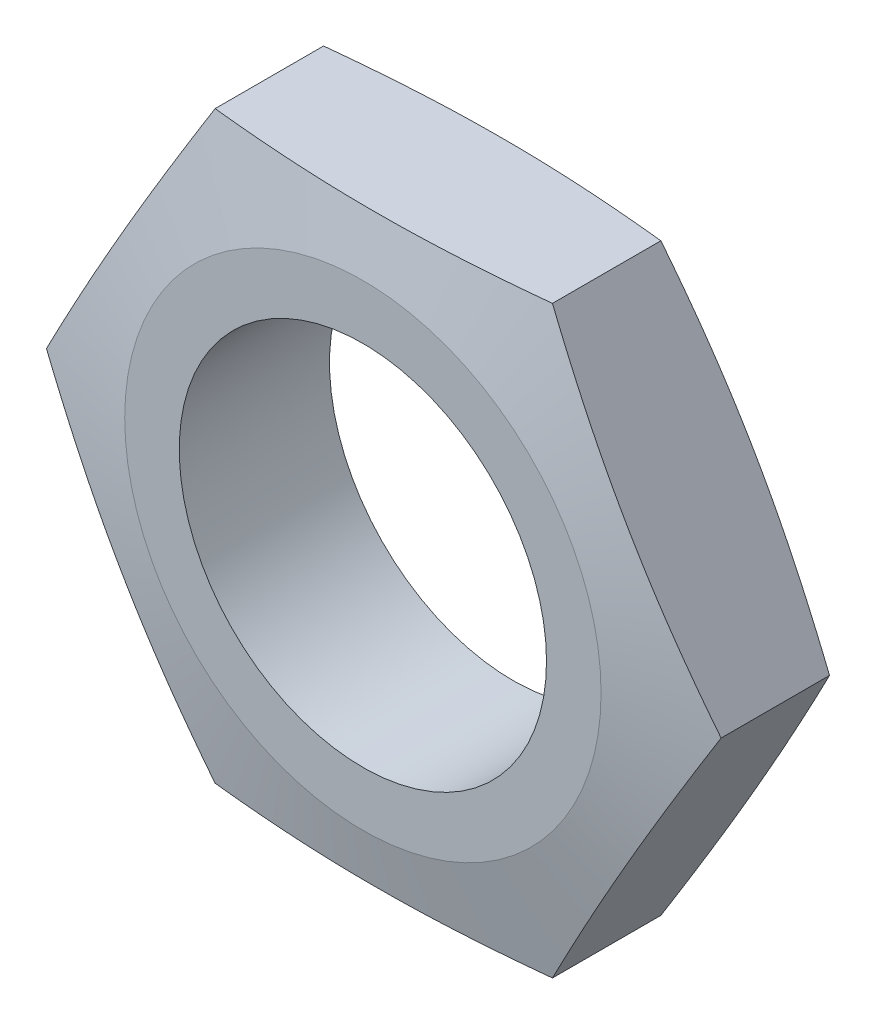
from build123d import *

# Parameters (mm, degrees)
SKETCH2_R          = 5.588
BASE_EXTRUDE_DEPTH = 2.286


with BuildPart() as part:
    # Sketch2 → Base-Extrude (new, symmetric)
    with BuildSketch(Plane.XY):
        Polygon((5.132643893, -8.89), (10.265287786, 0), (5.132643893, 8.89), (-5.132643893, 8.89), (-10.265287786, 0), (-5.132643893, -8.89), align=None)
        Circle(SKETCH2_R, mode=Mode.SUBTRACT)
    extrude(amount=BASE_EXTRUDE_DEPTH, both=True)

    # Sketch4 → Cut-Revolve1 (revolve, cut)
    with BuildSketch(Plane(origin=(0, 0, 0), x_dir=(1, 0, 0), z_dir=(0, 1, 0)), mode=Mode.PRIVATE) as cut_revolve1_sk:
        Polygon((7.247897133, 2.286), (10.265287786, 1.64964364), (10.265287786, 2.286), align=None)
        Polygon((7.247897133, -2.286), (10.265287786, -1.64964364), (10.265287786, -2.286), align=None)
    revolve(cut_revolve1_sk.sketch.rotate(Axis((0, 0, -3.557999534), (0, 0, 1)), 180), axis=Axis((0, 0, -3.557999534), (0, 0, 1)), mode=Mode.SUBTRACT)


solid = part.part
